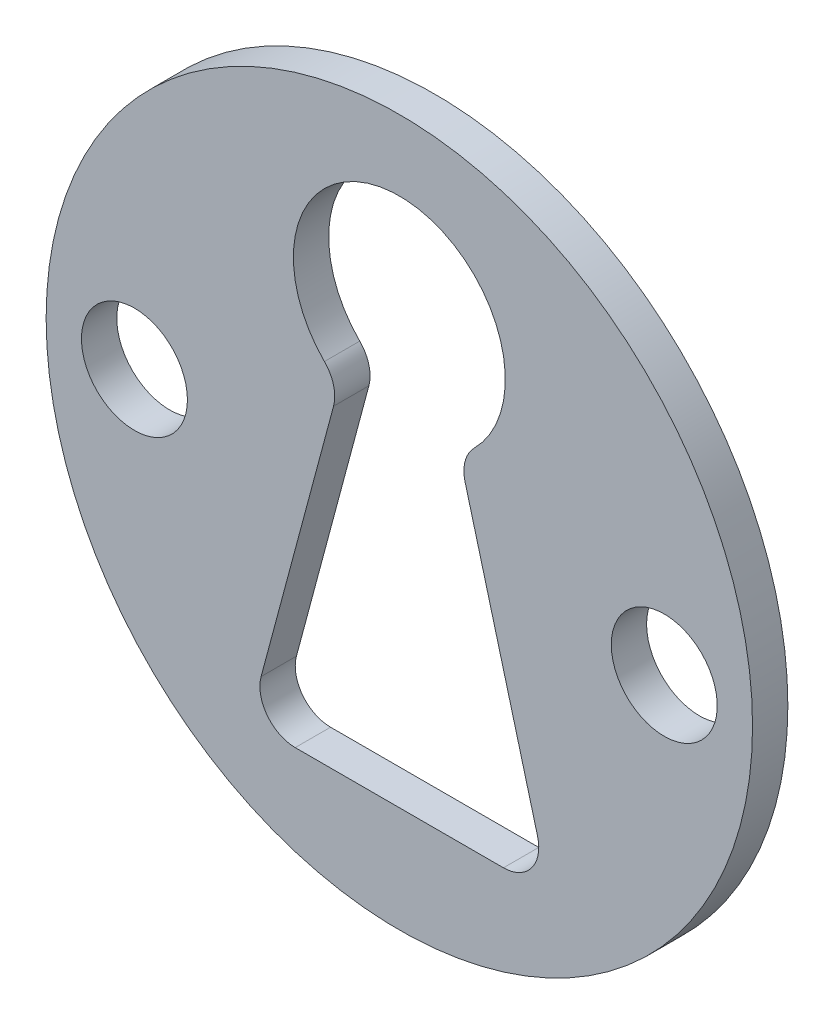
ISO-10303-21;
HEADER;
FILE_DESCRIPTION(('STEP AP214'),'2;1');
FILE_NAME('part.step','',(''),(''),'','','');
FILE_SCHEMA(('AUTOMOTIVE_DESIGN { 1 0 10303 214 1 1 1 1 }'));
ENDSEC;
DATA;
#1=APPLICATION_CONTEXT('core data for automotive mechanical design processes');
#2=APPLICATION_PROTOCOL_DEFINITION('international standard','automotive_design',2000,#1);
#3=PRODUCT_CONTEXT('',#1,'mechanical');
#4=PRODUCT('Part','Part','',(#3));
#5=PRODUCT_RELATED_PRODUCT_CATEGORY('part','',(#4));
#6=PRODUCT_DEFINITION_FORMATION('','',#4);
#7=PRODUCT_DEFINITION_CONTEXT('part definition',#1,'design');
#8=PRODUCT_DEFINITION('design','',#6,#7);
#9=PRODUCT_DEFINITION_SHAPE('','',#8);
#10=(LENGTH_UNIT() NAMED_UNIT(*) SI_UNIT(.MILLI.,.METRE.));
#11=(NAMED_UNIT(*) PLANE_ANGLE_UNIT() SI_UNIT($,.RADIAN.));
#12=(NAMED_UNIT(*) SI_UNIT($,.STERADIAN.) SOLID_ANGLE_UNIT());
#13=UNCERTAINTY_MEASURE_WITH_UNIT(LENGTH_MEASURE(1.E-05),#10,'distance_accuracy_value','');
#14=(GEOMETRIC_REPRESENTATION_CONTEXT(3) GLOBAL_UNCERTAINTY_ASSIGNED_CONTEXT((#13)) GLOBAL_UNIT_ASSIGNED_CONTEXT((#10,
#11,#12)) REPRESENTATION_CONTEXT('',''));
#15=CARTESIAN_POINT('',(0.,0.,0.));
#16=DIRECTION('',(0.,0.,1.));
#17=DIRECTION('',(1.,0.,0.));
#18=AXIS2_PLACEMENT_3D('',#15,#16,#17);
#19=CARTESIAN_POINT('',(0.,0.,1.));
#20=DIRECTION('',(0.,0.,1.));
#21=DIRECTION('',(1.,0.,0.));
#22=AXIS2_PLACEMENT_3D('',#19,#20,#21);
#23=PLANE('',#22);
#24=CARTESIAN_POINT('',(7.5,0.,1.));
#25=DIRECTION('',(0.,0.,1.));
#26=DIRECTION('',(-1.,0.,0.));
#27=AXIS2_PLACEMENT_3D('',#24,#25,#26);
#28=CIRCLE('',#27,1.5);
#29=CARTESIAN_POINT('',(6.,0.,1.));
#30=VERTEX_POINT('',#29);
#31=EDGE_CURVE('E160',#30,#30,#28,.T.);
#32=ORIENTED_EDGE('',*,*,#31,.F.);
#33=EDGE_LOOP('',(#32));
#34=FACE_BOUND('',#33,.T.);
#35=CARTESIAN_POINT('',(0.,0.,1.));
#36=DIRECTION('',(0.,0.,1.));
#37=DIRECTION('',(1.,0.,0.));
#38=AXIS2_PLACEMENT_3D('',#35,#36,#37);
#39=CIRCLE('',#38,10.);
#40=CARTESIAN_POINT('',(10.,0.,1.));
#41=VERTEX_POINT('',#40);
#42=EDGE_CURVE('E11',#41,#41,#39,.T.);
#43=ORIENTED_EDGE('',*,*,#42,.T.);
#44=EDGE_LOOP('',(#43));
#45=FACE_BOUND('',#44,.T.);
#46=CARTESIAN_POINT('',(-7.5,0.,1.));
#47=DIRECTION('',(0.,0.,1.));
#48=DIRECTION('',(1.,0.,0.));
#49=AXIS2_PLACEMENT_3D('',#46,#47,#48);
#50=CIRCLE('',#49,1.5);
#51=CARTESIAN_POINT('',(-6.,0.,1.));
#52=VERTEX_POINT('',#51);
#53=EDGE_CURVE('E166',#52,#52,#50,.T.);
#54=ORIENTED_EDGE('',*,*,#53,.F.);
#55=EDGE_LOOP('',(#54));
#56=FACE_BOUND('',#55,.T.);
#57=DIRECTION('',(-0.258819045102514,-0.96592582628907,0.));
#58=VECTOR('',#57,1.);
#59=CARTESIAN_POINT('',(-3.91336694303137,-5.74118095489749,1.));
#60=LINE('',#59,#58);
#61=CARTESIAN_POINT('',(-1.86250129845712,1.9127538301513,1.));
#62=VERTEX_POINT('',#61);
#63=CARTESIAN_POINT('',(-3.91336694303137,-5.74118095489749,1.));
#64=VERTEX_POINT('',#63);
#65=EDGE_CURVE('E103',#62,#64,#60,.T.);
#66=ORIENTED_EDGE('',*,*,#65,.F.);
#67=CARTESIAN_POINT('',(-2.82842712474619,2.17157287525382,1.));
#68=DIRECTION('',(0.,0.,-1.));
#69=DIRECTION('',(1.,0.,0.));
#70=AXIS2_PLACEMENT_3D('',#67,#68,#69);
#71=CIRCLE('',#70,1.);
#72=CARTESIAN_POINT('',(-2.12132034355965,2.87867965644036,1.));
#73=VERTEX_POINT('',#72);
#74=EDGE_CURVE('E95',#73,#62,#71,.T.);
#75=ORIENTED_EDGE('',*,*,#74,.F.);
#76=CARTESIAN_POINT('',(0.,5.,1.));
#77=DIRECTION('',(0.,0.,1.));
#78=DIRECTION('',(1.,0.,0.));
#79=AXIS2_PLACEMENT_3D('',#76,#77,#78);
#80=CIRCLE('',#79,3.);
#81=CARTESIAN_POINT('',(2.12132034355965,2.87867965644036,1.));
#82=VERTEX_POINT('',#81);
#83=EDGE_CURVE('E128',#82,#73,#80,.T.);
#84=ORIENTED_EDGE('',*,*,#83,.F.);
#85=CARTESIAN_POINT('',(2.8284271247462,2.17157287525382,1.));
#86=DIRECTION('',(0.,0.,-1.));
#87=DIRECTION('',(-1.,0.,0.));
#88=AXIS2_PLACEMENT_3D('',#85,#86,#87);
#89=CIRCLE('',#88,1.);
#90=CARTESIAN_POINT('',(1.86250129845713,1.9127538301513,1.));
#91=VERTEX_POINT('',#90);
#92=EDGE_CURVE('E126',#91,#82,#89,.T.);
#93=ORIENTED_EDGE('',*,*,#92,.F.);
#94=DIRECTION('',(-0.258819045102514,0.96592582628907,0.));
#95=VECTOR('',#94,1.);
#96=CARTESIAN_POINT('',(3.91336694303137,-5.74118095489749,1.));
#97=LINE('',#96,#95);
#98=CARTESIAN_POINT('',(3.91336694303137,-5.74118095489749,1.));
#99=VERTEX_POINT('',#98);
#100=EDGE_CURVE('E124',#99,#91,#97,.T.);
#101=ORIENTED_EDGE('',*,*,#100,.F.);
#102=CARTESIAN_POINT('',(2.9474411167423,-6.,1.));
#103=DIRECTION('',(0.,0.,1.));
#104=DIRECTION('',(1.,0.,0.));
#105=AXIS2_PLACEMENT_3D('',#102,#103,#104);
#106=CIRCLE('',#105,1.);
#107=CARTESIAN_POINT('',(2.9474411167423,-7.,1.));
#108=VERTEX_POINT('',#107);
#109=EDGE_CURVE('E122',#108,#99,#106,.T.);
#110=ORIENTED_EDGE('',*,*,#109,.F.);
#111=DIRECTION('',(1.,0.,0.));
#112=VECTOR('',#111,1.);
#113=CARTESIAN_POINT('',(-2.9474411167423,-7.,1.));
#114=LINE('',#113,#112);
#115=CARTESIAN_POINT('',(-2.9474411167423,-7.,1.));
#116=VERTEX_POINT('',#115);
#117=EDGE_CURVE('E118',#116,#108,#114,.T.);
#118=ORIENTED_EDGE('',*,*,#117,.F.);
#119=CARTESIAN_POINT('',(-2.9474411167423,-6.,1.));
#120=DIRECTION('',(0.,0.,1.));
#121=DIRECTION('',(-1.,0.,0.));
#122=AXIS2_PLACEMENT_3D('',#119,#120,#121);
#123=CIRCLE('',#122,1.);
#124=EDGE_CURVE('E116',#64,#116,#123,.T.);
#125=ORIENTED_EDGE('',*,*,#124,.F.);
#126=EDGE_LOOP('',(#66,#75,#84,#93,#101,#110,#118,#125));
#127=FACE_BOUND('',#126,.T.);
#128=ADVANCED_FACE('F30',(#34,#45,#56,#127),#23,.T.);
#129=CARTESIAN_POINT('',(0.,0.,0.));
#130=DIRECTION('',(0.,0.,1.));
#131=DIRECTION('',(1.,0.,0.));
#132=AXIS2_PLACEMENT_3D('',#129,#130,#131);
#133=PLANE('',#132);
#134=CARTESIAN_POINT('',(7.5,0.,0.));
#135=DIRECTION('',(0.,0.,1.));
#136=DIRECTION('',(-1.,0.,0.));
#137=AXIS2_PLACEMENT_3D('',#134,#135,#136);
#138=CIRCLE('',#137,1.5);
#139=CARTESIAN_POINT('',(6.,0.,0.));
#140=VERTEX_POINT('',#139);
#141=EDGE_CURVE('E111',#140,#140,#138,.T.);
#142=ORIENTED_EDGE('',*,*,#141,.T.);
#143=EDGE_LOOP('',(#142));
#144=FACE_BOUND('',#143,.T.);
#145=CARTESIAN_POINT('',(0.,0.,0.));
#146=DIRECTION('',(0.,0.,1.));
#147=DIRECTION('',(1.,0.,0.));
#148=AXIS2_PLACEMENT_3D('',#145,#146,#147);
#149=CIRCLE('',#148,10.);
#150=CARTESIAN_POINT('',(10.,0.,0.));
#151=VERTEX_POINT('',#150);
#152=EDGE_CURVE('E34',#151,#151,#149,.T.);
#153=ORIENTED_EDGE('',*,*,#152,.F.);
#154=EDGE_LOOP('',(#153));
#155=FACE_BOUND('',#154,.T.);
#156=CARTESIAN_POINT('',(-7.5,0.,0.));
#157=DIRECTION('',(0.,0.,1.));
#158=DIRECTION('',(1.,0.,0.));
#159=AXIS2_PLACEMENT_3D('',#156,#157,#158);
#160=CIRCLE('',#159,1.5);
#161=CARTESIAN_POINT('',(-6.,0.,0.));
#162=VERTEX_POINT('',#161);
#163=EDGE_CURVE('E163',#162,#162,#160,.T.);
#164=ORIENTED_EDGE('',*,*,#163,.T.);
#165=EDGE_LOOP('',(#164));
#166=FACE_BOUND('',#165,.T.);
#167=CARTESIAN_POINT('',(-2.82842712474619,2.17157287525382,0.));
#168=DIRECTION('',(0.,0.,-1.));
#169=DIRECTION('',(1.,0.,0.));
#170=AXIS2_PLACEMENT_3D('',#167,#168,#169);
#171=CIRCLE('',#170,1.);
#172=CARTESIAN_POINT('',(-2.12132034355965,2.87867965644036,0.));
#173=VERTEX_POINT('',#172);
#174=CARTESIAN_POINT('',(-1.86250129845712,1.9127538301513,0.));
#175=VERTEX_POINT('',#174);
#176=EDGE_CURVE('E53',#173,#175,#171,.T.);
#177=ORIENTED_EDGE('',*,*,#176,.T.);
#178=DIRECTION('',(-0.258819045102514,-0.96592582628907,0.));
#179=VECTOR('',#178,1.);
#180=CARTESIAN_POINT('',(-3.91336694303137,-5.74118095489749,0.));
#181=LINE('',#180,#179);
#182=CARTESIAN_POINT('',(-3.91336694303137,-5.74118095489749,0.));
#183=VERTEX_POINT('',#182);
#184=EDGE_CURVE('E110',#175,#183,#181,.T.);
#185=ORIENTED_EDGE('',*,*,#184,.T.);
#186=CARTESIAN_POINT('',(-2.9474411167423,-6.,0.));
#187=DIRECTION('',(0.,0.,1.));
#188=DIRECTION('',(-1.,0.,0.));
#189=AXIS2_PLACEMENT_3D('',#186,#187,#188);
#190=CIRCLE('',#189,1.);
#191=CARTESIAN_POINT('',(-2.9474411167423,-7.,0.));
#192=VERTEX_POINT('',#191);
#193=EDGE_CURVE('E132',#183,#192,#190,.T.);
#194=ORIENTED_EDGE('',*,*,#193,.T.);
#195=DIRECTION('',(1.,0.,0.));
#196=VECTOR('',#195,1.);
#197=CARTESIAN_POINT('',(-2.9474411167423,-7.,0.));
#198=LINE('',#197,#196);
#199=CARTESIAN_POINT('',(2.9474411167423,-7.,0.));
#200=VERTEX_POINT('',#199);
#201=EDGE_CURVE('E135',#192,#200,#198,.T.);
#202=ORIENTED_EDGE('',*,*,#201,.T.);
#203=CARTESIAN_POINT('',(2.9474411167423,-6.,0.));
#204=DIRECTION('',(0.,0.,1.));
#205=DIRECTION('',(1.,0.,0.));
#206=AXIS2_PLACEMENT_3D('',#203,#204,#205);
#207=CIRCLE('',#206,1.);
#208=CARTESIAN_POINT('',(3.91336694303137,-5.74118095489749,0.));
#209=VERTEX_POINT('',#208);
#210=EDGE_CURVE('E138',#200,#209,#207,.T.);
#211=ORIENTED_EDGE('',*,*,#210,.T.);
#212=DIRECTION('',(-0.258819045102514,0.96592582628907,0.));
#213=VECTOR('',#212,1.);
#214=CARTESIAN_POINT('',(3.91336694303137,-5.74118095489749,0.));
#215=LINE('',#214,#213);
#216=CARTESIAN_POINT('',(1.86250129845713,1.9127538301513,0.));
#217=VERTEX_POINT('',#216);
#218=EDGE_CURVE('E141',#209,#217,#215,.T.);
#219=ORIENTED_EDGE('',*,*,#218,.T.);
#220=CARTESIAN_POINT('',(2.8284271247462,2.17157287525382,0.));
#221=DIRECTION('',(0.,0.,-1.));
#222=DIRECTION('',(-1.,0.,0.));
#223=AXIS2_PLACEMENT_3D('',#220,#221,#222);
#224=CIRCLE('',#223,1.);
#225=CARTESIAN_POINT('',(2.12132034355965,2.87867965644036,0.));
#226=VERTEX_POINT('',#225);
#227=EDGE_CURVE('E144',#217,#226,#224,.T.);
#228=ORIENTED_EDGE('',*,*,#227,.T.);
#229=CARTESIAN_POINT('',(0.,5.,0.));
#230=DIRECTION('',(0.,0.,1.));
#231=DIRECTION('',(1.,0.,0.));
#232=AXIS2_PLACEMENT_3D('',#229,#230,#231);
#233=CIRCLE('',#232,3.);
#234=EDGE_CURVE('E104',#226,#173,#233,.T.);
#235=ORIENTED_EDGE('',*,*,#234,.T.);
#236=EDGE_LOOP('',(#177,#185,#194,#202,#211,#219,#228,#235));
#237=FACE_BOUND('',#236,.T.);
#238=ADVANCED_FACE('F172',(#144,#155,#166,#237),#133,.F.);
#239=CARTESIAN_POINT('',(0.,0.,1.));
#240=DIRECTION('',(0.,0.,-1.));
#241=DIRECTION('',(-1.,0.,0.));
#242=AXIS2_PLACEMENT_3D('',#239,#240,#241);
#243=CYLINDRICAL_SURFACE('',#242,10.);
#244=ORIENTED_EDGE('',*,*,#42,.F.);
#245=EDGE_LOOP('',(#244));
#246=FACE_BOUND('',#245,.T.);
#247=ORIENTED_EDGE('',*,*,#152,.T.);
#248=EDGE_LOOP('',(#247));
#249=FACE_BOUND('',#248,.T.);
#250=ADVANCED_FACE('F32',(#246,#249),#243,.T.);
#251=CARTESIAN_POINT('',(-7.5,0.,1.));
#252=DIRECTION('',(0.,0.,-1.));
#253=DIRECTION('',(-1.,0.,0.));
#254=AXIS2_PLACEMENT_3D('',#251,#252,#253);
#255=CYLINDRICAL_SURFACE('',#254,1.5);
#256=ORIENTED_EDGE('',*,*,#53,.T.);
#257=EDGE_LOOP('',(#256));
#258=FACE_BOUND('',#257,.T.);
#259=ORIENTED_EDGE('',*,*,#163,.F.);
#260=EDGE_LOOP('',(#259));
#261=FACE_BOUND('',#260,.T.);
#262=ADVANCED_FACE('F175',(#258,#261),#255,.F.);
#263=CARTESIAN_POINT('',(7.5,0.,1.));
#264=DIRECTION('',(0.,0.,-1.));
#265=DIRECTION('',(-1.,0.,0.));
#266=AXIS2_PLACEMENT_3D('',#263,#264,#265);
#267=CYLINDRICAL_SURFACE('',#266,1.5);
#268=ORIENTED_EDGE('',*,*,#31,.T.);
#269=EDGE_LOOP('',(#268));
#270=FACE_BOUND('',#269,.T.);
#271=ORIENTED_EDGE('',*,*,#141,.F.);
#272=EDGE_LOOP('',(#271));
#273=FACE_BOUND('',#272,.T.);
#274=ADVANCED_FACE('F177',(#270,#273),#267,.F.);
#275=CARTESIAN_POINT('',(-2.82842712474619,2.17157287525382,1.));
#276=DIRECTION('',(0.,0.,-1.));
#277=DIRECTION('',(-1.,0.,0.));
#278=AXIS2_PLACEMENT_3D('',#275,#276,#277);
#279=CYLINDRICAL_SURFACE('',#278,1.);
#280=ORIENTED_EDGE('',*,*,#176,.F.);
#281=DIRECTION('',(0.,0.,-1.));
#282=VECTOR('',#281,1.);
#283=CARTESIAN_POINT('',(-2.12132034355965,2.87867965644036,1.));
#284=LINE('',#283,#282);
#285=EDGE_CURVE('E99',#73,#173,#284,.T.);
#286=ORIENTED_EDGE('',*,*,#285,.F.);
#287=ORIENTED_EDGE('',*,*,#74,.T.);
#288=DIRECTION('',(0.,0.,-1.));
#289=VECTOR('',#288,1.);
#290=CARTESIAN_POINT('',(-1.86250129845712,1.9127538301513,1.));
#291=LINE('',#290,#289);
#292=EDGE_CURVE('E98',#62,#175,#291,.T.);
#293=ORIENTED_EDGE('',*,*,#292,.T.);
#294=EDGE_LOOP('',(#280,#286,#287,#293));
#295=FACE_BOUND('',#294,.T.);
#296=ADVANCED_FACE('F97',(#295),#279,.T.);
#297=CARTESIAN_POINT('',(-3.91336694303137,-5.74118095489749,1.));
#298=DIRECTION('',(0.96592582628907,-0.258819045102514,0.));
#299=DIRECTION('',(0.258819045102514,0.96592582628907,0.));
#300=AXIS2_PLACEMENT_3D('',#297,#298,#299);
#301=PLANE('',#300);
#302=ORIENTED_EDGE('',*,*,#184,.F.);
#303=ORIENTED_EDGE('',*,*,#292,.F.);
#304=ORIENTED_EDGE('',*,*,#65,.T.);
#305=DIRECTION('',(0.,0.,-1.));
#306=VECTOR('',#305,1.);
#307=CARTESIAN_POINT('',(-3.91336694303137,-5.74118095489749,1.));
#308=LINE('',#307,#306);
#309=EDGE_CURVE('E112',#64,#183,#308,.T.);
#310=ORIENTED_EDGE('',*,*,#309,.T.);
#311=EDGE_LOOP('',(#302,#303,#304,#310));
#312=FACE_BOUND('',#311,.T.);
#313=ADVANCED_FACE('F107',(#312),#301,.T.);
#314=CARTESIAN_POINT('',(-2.9474411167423,-6.,1.));
#315=DIRECTION('',(0.,0.,-1.));
#316=DIRECTION('',(-1.,0.,0.));
#317=AXIS2_PLACEMENT_3D('',#314,#315,#316);
#318=CYLINDRICAL_SURFACE('',#317,1.);
#319=ORIENTED_EDGE('',*,*,#193,.F.);
#320=ORIENTED_EDGE('',*,*,#309,.F.);
#321=ORIENTED_EDGE('',*,*,#124,.T.);
#322=DIRECTION('',(0.,0.,-1.));
#323=VECTOR('',#322,1.);
#324=CARTESIAN_POINT('',(-2.9474411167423,-7.,1.));
#325=LINE('',#324,#323);
#326=EDGE_CURVE('E157',#116,#192,#325,.T.);
#327=ORIENTED_EDGE('',*,*,#326,.T.);
#328=EDGE_LOOP('',(#319,#320,#321,#327));
#329=FACE_BOUND('',#328,.T.);
#330=ADVANCED_FACE('F241',(#329),#318,.F.);
#331=CARTESIAN_POINT('',(-2.9474411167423,-7.,1.));
#332=DIRECTION('',(0.,1.,0.));
#333=DIRECTION('',(-1.,0.,0.));
#334=AXIS2_PLACEMENT_3D('',#331,#332,#333);
#335=PLANE('',#334);
#336=ORIENTED_EDGE('',*,*,#201,.F.);
#337=ORIENTED_EDGE('',*,*,#326,.F.);
#338=ORIENTED_EDGE('',*,*,#117,.T.);
#339=DIRECTION('',(0.,0.,-1.));
#340=VECTOR('',#339,1.);
#341=CARTESIAN_POINT('',(2.9474411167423,-7.,1.));
#342=LINE('',#341,#340);
#343=EDGE_CURVE('E155',#108,#200,#342,.T.);
#344=ORIENTED_EDGE('',*,*,#343,.T.);
#345=EDGE_LOOP('',(#336,#337,#338,#344));
#346=FACE_BOUND('',#345,.T.);
#347=ADVANCED_FACE('F250',(#346),#335,.T.);
#348=CARTESIAN_POINT('',(2.9474411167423,-6.,1.));
#349=DIRECTION('',(0.,0.,-1.));
#350=DIRECTION('',(-1.,0.,0.));
#351=AXIS2_PLACEMENT_3D('',#348,#349,#350);
#352=CYLINDRICAL_SURFACE('',#351,1.);
#353=ORIENTED_EDGE('',*,*,#210,.F.);
#354=ORIENTED_EDGE('',*,*,#343,.F.);
#355=ORIENTED_EDGE('',*,*,#109,.T.);
#356=DIRECTION('',(0.,0.,-1.));
#357=VECTOR('',#356,1.);
#358=CARTESIAN_POINT('',(3.91336694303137,-5.74118095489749,1.));
#359=LINE('',#358,#357);
#360=EDGE_CURVE('E153',#99,#209,#359,.T.);
#361=ORIENTED_EDGE('',*,*,#360,.T.);
#362=EDGE_LOOP('',(#353,#354,#355,#361));
#363=FACE_BOUND('',#362,.T.);
#364=ADVANCED_FACE('F260',(#363),#352,.F.);
#365=CARTESIAN_POINT('',(3.91336694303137,-5.74118095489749,1.));
#366=DIRECTION('',(-0.96592582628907,-0.258819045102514,0.));
#367=DIRECTION('',(0.258819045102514,-0.96592582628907,0.));
#368=AXIS2_PLACEMENT_3D('',#365,#366,#367);
#369=PLANE('',#368);
#370=ORIENTED_EDGE('',*,*,#218,.F.);
#371=ORIENTED_EDGE('',*,*,#360,.F.);
#372=ORIENTED_EDGE('',*,*,#100,.T.);
#373=DIRECTION('',(0.,0.,-1.));
#374=VECTOR('',#373,1.);
#375=CARTESIAN_POINT('',(1.86250129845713,1.9127538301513,1.));
#376=LINE('',#375,#374);
#377=EDGE_CURVE('E151',#91,#217,#376,.T.);
#378=ORIENTED_EDGE('',*,*,#377,.T.);
#379=EDGE_LOOP('',(#370,#371,#372,#378));
#380=FACE_BOUND('',#379,.T.);
#381=ADVANCED_FACE('F270',(#380),#369,.T.);
#382=CARTESIAN_POINT('',(2.8284271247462,2.17157287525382,1.));
#383=DIRECTION('',(0.,0.,-1.));
#384=DIRECTION('',(-1.,0.,0.));
#385=AXIS2_PLACEMENT_3D('',#382,#383,#384);
#386=CYLINDRICAL_SURFACE('',#385,1.);
#387=ORIENTED_EDGE('',*,*,#227,.F.);
#388=ORIENTED_EDGE('',*,*,#377,.F.);
#389=ORIENTED_EDGE('',*,*,#92,.T.);
#390=DIRECTION('',(0.,0.,-1.));
#391=VECTOR('',#390,1.);
#392=CARTESIAN_POINT('',(2.12132034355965,2.87867965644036,1.));
#393=LINE('',#392,#391);
#394=EDGE_CURVE('E45',#82,#226,#393,.T.);
#395=ORIENTED_EDGE('',*,*,#394,.T.);
#396=EDGE_LOOP('',(#387,#388,#389,#395));
#397=FACE_BOUND('',#396,.T.);
#398=ADVANCED_FACE('F280',(#397),#386,.T.);
#399=CARTESIAN_POINT('',(0.,5.,1.));
#400=DIRECTION('',(0.,0.,-1.));
#401=DIRECTION('',(-1.,0.,0.));
#402=AXIS2_PLACEMENT_3D('',#399,#400,#401);
#403=CYLINDRICAL_SURFACE('',#402,3.);
#404=ORIENTED_EDGE('',*,*,#234,.F.);
#405=ORIENTED_EDGE('',*,*,#394,.F.);
#406=ORIENTED_EDGE('',*,*,#83,.T.);
#407=ORIENTED_EDGE('',*,*,#285,.T.);
#408=EDGE_LOOP('',(#404,#405,#406,#407));
#409=FACE_BOUND('',#408,.T.);
#410=ADVANCED_FACE('F290',(#409),#403,.F.);
#411=CLOSED_SHELL('',(#128,#238,#250,#262,#274,#296,#313,#330,#347,#364,#381,#398,#410));
#412=MANIFOLD_SOLID_BREP('B2',#411);
#413=ADVANCED_BREP_SHAPE_REPRESENTATION('',(#18,#412),#14);
#414=SHAPE_DEFINITION_REPRESENTATION(#9,#413);
ENDSEC;
END-ISO-10303-21;
